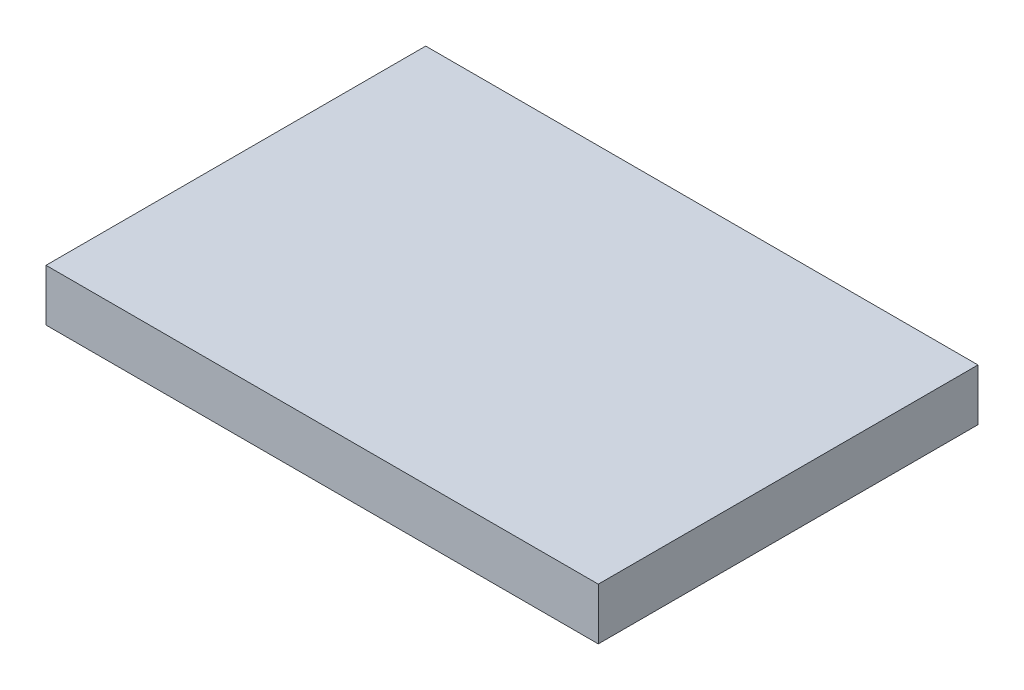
from build123d import *

# Parameters (mm, degrees)
SKETCH1_W          = 203.2
SKETCH1_H          = 19.05
EXTRUDE1_DEPTH     = 139.7
SKETCH2_W          = 25.4
SKETCH2_H          = 7.9375
CUT_EXTRUDE1_DEPTH = 0.79375


with BuildPart() as part:
    # Sketch1 → Extrude1 (new body)
    with BuildSketch(Plane.XY):
        with Locations((101.6, 9.525)):
            Rectangle(SKETCH1_W, SKETCH1_H)
    extrude(amount=EXTRUDE1_DEPTH)

    # Sketch2 → Cut-Extrude1 (cut)
    with BuildSketch(Plane.XZ):
        with Locations((101.6, 126.20625)):
            Rectangle(SKETCH2_W, SKETCH2_H)
    extrude(amount=-CUT_EXTRUDE1_DEPTH, mode=Mode.SUBTRACT)


solid = part.part
